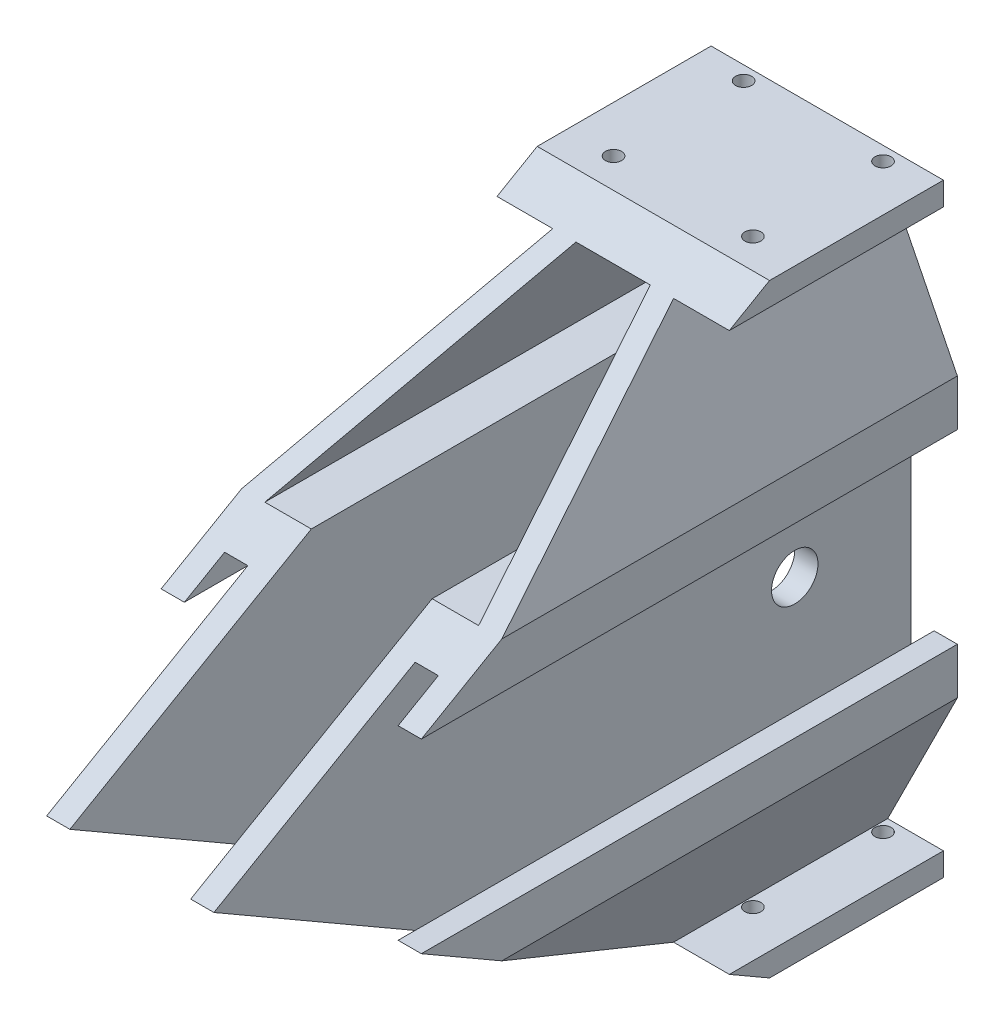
from build123d import *

# Parameters (mm, degrees)
MAIN_DEPTH                     = 150
STOCK_MOUNT_HOLE_DEPTH         = 166.858373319
STOCK_MOUNT_HOLE_DEPTH_BACK    = 166.858373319
SKETCH2_R                      = 5
TOP_ANGLED_CUT_DEPTH           = 166.858373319
F_8_32_TAPPED_HOLE1_AT_2_COUNT = 2
F_8_32_TAPPED_HOLE1_AT_2_PITCH = 30
F_8_32_TAPPED_HOLE1_AT_3_COUNT = 2
F_8_32_TAPPED_HOLE1_AT_3_PITCH = 28
F_8_32_TAPPED_HOLE1_AT_4_COUNT = 2
F_8_32_TAPPED_HOLE1_AT_4_PITCH = 41.036569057


with BuildPart() as part:
    # Sketch1 → main (new body)
    with BuildSketch(Plane.XY):
        Polygon((-18, 25), (-23, 25), (-23, 20), (-28, 20), (-28, 30), (-13, 60), (-25, 60), (-25, 65), (25, 65), (25, 60), (13, 60), (28, 30), (28, 20), (23, 20), (23, 25), (18, 25), (18, -25), (23, -25), (23, -20), (28, -20), (28, -30), (13, -60), (25, -60), (25, -65), (-25, -65), (-25, -60), (-13, -60), (-28, -30), (-28, -20), (-23, -20), (-23, -25), (-18, -25), align=None)
        Polygon((-13, 30), (-13, -30), (-23, -30), (-8, -60), (0, -60), (8, -60), (23, -30), (13, -30), (13, 30), (23, 30), (8, 60), (0, 60), (-8, 60), (-23, 30), align=None, mode=Mode.SUBTRACT)
    extrude(amount=-MAIN_DEPTH)

    # Sketch2 → stock mount hole (cut, two sides: drawn at the far end of the back side and taken through both)
    with BuildSketch(Plane(origin=(0, 0, 0), x_dir=(0, 0, -1), z_dir=(1, 0, 0)).offset(-STOCK_MOUNT_HOLE_DEPTH_BACK)):
        with Locations((125, 0)):
            Circle(SKETCH2_R)
    extrude(amount=STOCK_MOUNT_HOLE_DEPTH + STOCK_MOUNT_HOLE_DEPTH_BACK, mode=Mode.SUBTRACT)

    # Sketch3 → top angled cut (cut, symmetric)
    with BuildSketch(Plane(origin=(0, 0, 0), x_dir=(0, 0, -1), z_dir=(1, 0, 0))):
        Polygon((0, 0), (112.583302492, 65), (0, 65), align=None)
    top_angled_cut = extrude(amount=TOP_ANGLED_CUT_DEPTH, both=True, mode=Mode.SUBTRACT)

    # bottom angled cut: top angled cut across plane
    add(top_angled_cut.mirror(Plane.ZX), mode=Mode.SUBTRACT)

    # Sketch5 → 8-32 Tapped Hole1 (revolve, cut)
    with BuildSketch(Plane(origin=(-15, 65, -147), x_dir=(0, 0, 1), z_dir=(1, 0, 0))):
        Polygon((0, 0), (0, 6.037806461), (1.7272, 5), (1.7272, 0), align=None)
    f_8_32_tapped_hole1 = revolve(axis=Axis((-15, 71.35, -147), (0, -1, 0)), mode=Mode.SUBTRACT)

    # 8-32 Tapped Hole1 at 2: 8-32 Tapped Hole1 ×2
    with Locations(*[(i * F_8_32_TAPPED_HOLE1_AT_2_PITCH, 0, 0) for i in range(1, F_8_32_TAPPED_HOLE1_AT_2_COUNT)]):
        add(f_8_32_tapped_hole1, mode=Mode.SUBTRACT)

    # 8-32 Tapped Hole1 at 3: 8-32 Tapped Hole1 ×2
    with Locations(*[(0, 0, i * F_8_32_TAPPED_HOLE1_AT_3_PITCH) for i in range(1, F_8_32_TAPPED_HOLE1_AT_3_COUNT)]):
        add(f_8_32_tapped_hole1, mode=Mode.SUBTRACT)

    # 8-32 Tapped Hole1 at 4: 8-32 Tapped Hole1 ×2
    with Locations(*[Vector(0.731055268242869, 0, 0.6823182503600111) * (i * F_8_32_TAPPED_HOLE1_AT_4_PITCH) for i in range(1, F_8_32_TAPPED_HOLE1_AT_4_COUNT)]):
        add(f_8_32_tapped_hole1, mode=Mode.SUBTRACT)

    # tapped hole bottom: 8-32 Tapped Hole1 across plane
    add(f_8_32_tapped_hole1.mirror(Plane.ZX), mode=Mode.SUBTRACT)

    # tapped hole bottom copy 1 sketch → tapped hole bottom copy 1 (revolve, cut)
    with BuildSketch(Plane(origin=(15, -65, -147), x_dir=(0, 0, 1), z_dir=(1, 0, 0))):
        Polygon((0, 0), (0, -6.037806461), (1.7272, -5), (1.7272, 0), align=None)
    revolve(axis=Axis((15, -71.35, -147), (0, -1, 0)), mode=Mode.SUBTRACT)

    # tapped hole bottom copy 2 sketch → tapped hole bottom copy 2 (revolve, cut)
    with BuildSketch(Plane(origin=(-15, -65, -119), x_dir=(0, 0, 1), z_dir=(1, 0, 0))):
        Polygon((0, 0), (0, -6.037806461), (1.7272, -5), (1.7272, 0), align=None)
    revolve(axis=Axis((-15, -71.35, -119), (0, -1, 0)), mode=Mode.SUBTRACT)

    # tapped hole bottom copy 3 sketch → tapped hole bottom copy 3 (revolve, cut)
    with BuildSketch(Plane(origin=(15, -65, -119), x_dir=(0, 0, 1), z_dir=(1, 0, 0))):
        Polygon((0, 0), (0, -6.037806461), (1.7272, -5), (1.7272, 0), align=None)
    revolve(axis=Axis((15, -71.35, -119), (0, -1, 0)), mode=Mode.SUBTRACT)


solid = part.part
